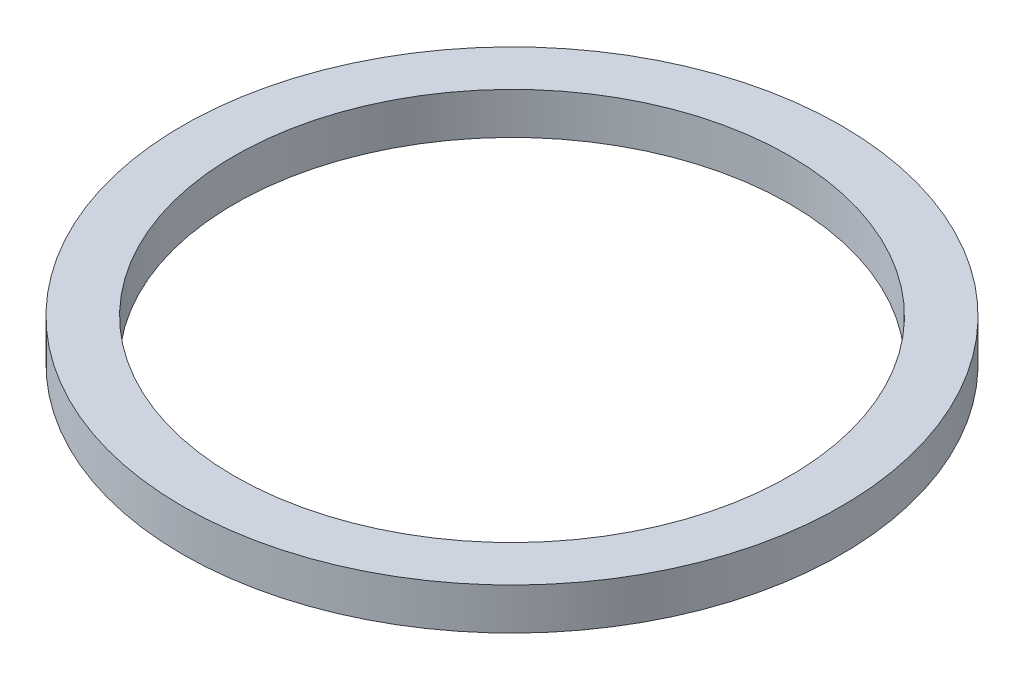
ISO-10303-21;
HEADER;
FILE_DESCRIPTION(('STEP AP214'),'2;1');
FILE_NAME('part.step','',(''),(''),'','','');
FILE_SCHEMA(('AUTOMOTIVE_DESIGN { 1 0 10303 214 1 1 1 1 }'));
ENDSEC;
DATA;
#1=APPLICATION_CONTEXT('core data for automotive mechanical design processes');
#2=APPLICATION_PROTOCOL_DEFINITION('international standard','automotive_design',2000,#1);
#3=PRODUCT_CONTEXT('',#1,'mechanical');
#4=PRODUCT('Part','Part','',(#3));
#5=PRODUCT_RELATED_PRODUCT_CATEGORY('part','',(#4));
#6=PRODUCT_DEFINITION_FORMATION('','',#4);
#7=PRODUCT_DEFINITION_CONTEXT('part definition',#1,'design');
#8=PRODUCT_DEFINITION('design','',#6,#7);
#9=PRODUCT_DEFINITION_SHAPE('','',#8);
#10=(LENGTH_UNIT() NAMED_UNIT(*) SI_UNIT(.MILLI.,.METRE.));
#11=(NAMED_UNIT(*) PLANE_ANGLE_UNIT() SI_UNIT($,.RADIAN.));
#12=(NAMED_UNIT(*) SI_UNIT($,.STERADIAN.) SOLID_ANGLE_UNIT());
#13=UNCERTAINTY_MEASURE_WITH_UNIT(LENGTH_MEASURE(1.E-05),#10,'distance_accuracy_value','');
#14=(GEOMETRIC_REPRESENTATION_CONTEXT(3) GLOBAL_UNCERTAINTY_ASSIGNED_CONTEXT((#13)) GLOBAL_UNIT_ASSIGNED_CONTEXT((#10,
#11,#12)) REPRESENTATION_CONTEXT('',''));
#15=CARTESIAN_POINT('',(0.,0.,0.));
#16=DIRECTION('',(0.,0.,1.));
#17=DIRECTION('',(1.,0.,0.));
#18=AXIS2_PLACEMENT_3D('',#15,#16,#17);
#19=CARTESIAN_POINT('',(0.,6.,0.));
#20=DIRECTION('',(0.,1.,0.));
#21=DIRECTION('',(0.,0.,1.));
#22=AXIS2_PLACEMENT_3D('',#19,#20,#21);
#23=PLANE('',#22);
#24=CARTESIAN_POINT('',(0.,6.,0.));
#25=DIRECTION('',(0.,1.,0.));
#26=DIRECTION('',(0.,0.,1.));
#27=AXIS2_PLACEMENT_3D('',#24,#25,#26);
#28=CIRCLE('',#27,47.5);
#29=CARTESIAN_POINT('',(0.,6.,47.5));
#30=VERTEX_POINT('',#29);
#31=EDGE_CURVE('E10',#30,#30,#28,.T.);
#32=ORIENTED_EDGE('',*,*,#31,.T.);
#33=EDGE_LOOP('',(#32));
#34=FACE_BOUND('',#33,.T.);
#35=CARTESIAN_POINT('',(0.,6.,0.));
#36=DIRECTION('',(0.,1.,0.));
#37=DIRECTION('',(0.,0.,1.));
#38=AXIS2_PLACEMENT_3D('',#35,#36,#37);
#39=CIRCLE('',#38,40.);
#40=CARTESIAN_POINT('',(0.,6.,40.));
#41=VERTEX_POINT('',#40);
#42=EDGE_CURVE('E42',#41,#41,#39,.T.);
#43=ORIENTED_EDGE('',*,*,#42,.F.);
#44=EDGE_LOOP('',(#43));
#45=FACE_BOUND('',#44,.T.);
#46=ADVANCED_FACE('F31',(#34,#45),#23,.T.);
#47=CARTESIAN_POINT('',(0.,0.,0.));
#48=DIRECTION('',(0.,1.,0.));
#49=DIRECTION('',(0.,0.,1.));
#50=AXIS2_PLACEMENT_3D('',#47,#48,#49);
#51=PLANE('',#50);
#52=CARTESIAN_POINT('',(0.,0.,0.));
#53=DIRECTION('',(0.,1.,0.));
#54=DIRECTION('',(0.,0.,1.));
#55=AXIS2_PLACEMENT_3D('',#52,#53,#54);
#56=CIRCLE('',#55,47.5);
#57=CARTESIAN_POINT('',(0.,0.,47.5));
#58=VERTEX_POINT('',#57);
#59=EDGE_CURVE('E38',#58,#58,#56,.T.);
#60=ORIENTED_EDGE('',*,*,#59,.F.);
#61=EDGE_LOOP('',(#60));
#62=FACE_BOUND('',#61,.T.);
#63=CARTESIAN_POINT('',(0.,0.,0.));
#64=DIRECTION('',(0.,1.,0.));
#65=DIRECTION('',(0.,0.,1.));
#66=AXIS2_PLACEMENT_3D('',#63,#64,#65);
#67=CIRCLE('',#66,40.);
#68=CARTESIAN_POINT('',(0.,0.,40.));
#69=VERTEX_POINT('',#68);
#70=EDGE_CURVE('E46',#69,#69,#67,.T.);
#71=ORIENTED_EDGE('',*,*,#70,.T.);
#72=EDGE_LOOP('',(#71));
#73=FACE_BOUND('',#72,.T.);
#74=ADVANCED_FACE('F52',(#62,#73),#51,.F.);
#75=CARTESIAN_POINT('',(0.,6.,0.));
#76=DIRECTION('',(0.,-1.,0.));
#77=DIRECTION('',(0.,0.,-1.));
#78=AXIS2_PLACEMENT_3D('',#75,#76,#77);
#79=CYLINDRICAL_SURFACE('',#78,47.5);
#80=ORIENTED_EDGE('',*,*,#31,.F.);
#81=EDGE_LOOP('',(#80));
#82=FACE_BOUND('',#81,.T.);
#83=ORIENTED_EDGE('',*,*,#59,.T.);
#84=EDGE_LOOP('',(#83));
#85=FACE_BOUND('',#84,.T.);
#86=ADVANCED_FACE('F33',(#82,#85),#79,.T.);
#87=CARTESIAN_POINT('',(0.,6.,0.));
#88=DIRECTION('',(0.,-1.,0.));
#89=DIRECTION('',(0.,0.,-1.));
#90=AXIS2_PLACEMENT_3D('',#87,#88,#89);
#91=CYLINDRICAL_SURFACE('',#90,40.);
#92=ORIENTED_EDGE('',*,*,#42,.T.);
#93=EDGE_LOOP('',(#92));
#94=FACE_BOUND('',#93,.T.);
#95=ORIENTED_EDGE('',*,*,#70,.F.);
#96=EDGE_LOOP('',(#95));
#97=FACE_BOUND('',#96,.T.);
#98=ADVANCED_FACE('F54',(#94,#97),#91,.F.);
#99=CLOSED_SHELL('',(#46,#74,#86,#98));
#100=MANIFOLD_SOLID_BREP('B2',#99);
#101=ADVANCED_BREP_SHAPE_REPRESENTATION('',(#18,#100),#14);
#102=SHAPE_DEFINITION_REPRESENTATION(#9,#101);
ENDSEC;
END-ISO-10303-21;
